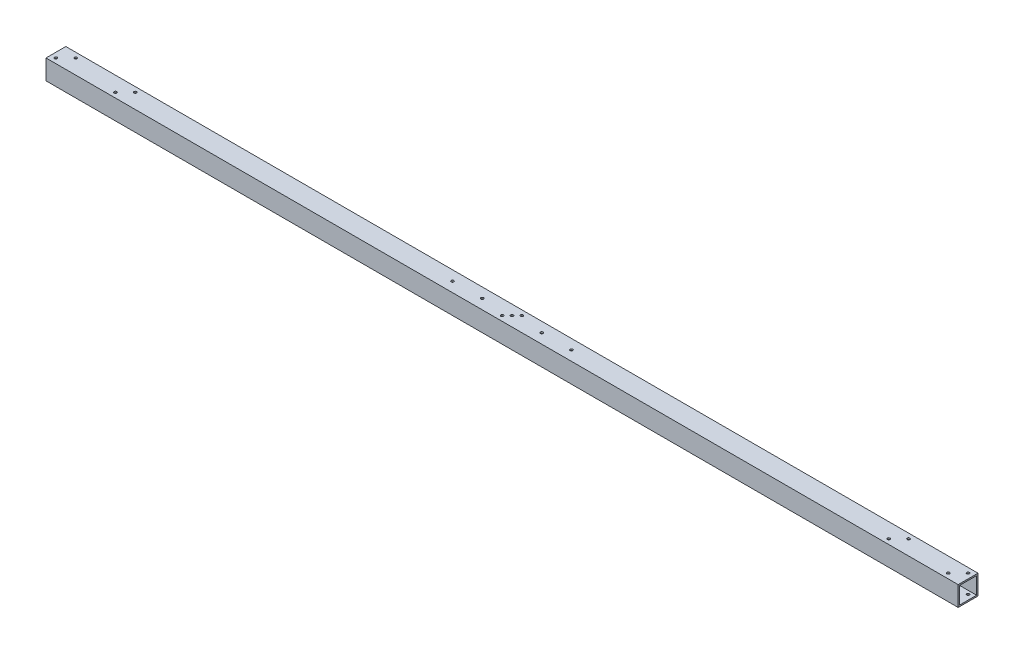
from build123d import *

# Parameters (mm, degrees)
SKETCH1_W          = 50.8
SKETCH1_H          = 50.8
SKETCH1_W_2        = 43.4848
SKETCH1_H_2        = 43.4848
EXTRUDE1_DEPTH     = 2336.8
SKETCH3_R          = 3.37312
CUT_EXTRUDE1_DEPTH = 2338.904086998
SKETCH4_R          = 3.37312
CUT_EXTRUDE2_DEPTH = 2338.904086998
SKETCH5_R          = 3.37312
CUT_EXTRUDE3_DEPTH = 2338.904086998


with BuildPart() as part:
    # Sketch1 → Extrude1 (new body)
    with BuildSketch(Plane(origin=(0, 0, 0), x_dir=(0, 0, -1), z_dir=(1, 0, 0))):
        with Locations((25.4, 25.4)):
            Rectangle(SKETCH1_W, SKETCH1_H)
        with Locations((25.4, 25.4)):
            Rectangle(SKETCH1_W_2, SKETCH1_H_2, mode=Mode.SUBTRACT)
    extrude(amount=EXTRUDE1_DEPTH)

    # Sketch3 → Cut-Extrude1 (cut, through all)
    with BuildSketch(Plane(origin=(0, 50.8, 0), x_dir=(1, 0, 0), z_dir=(0, 1, 0))):
        with Locations(Location((12.7, 12.7, 0), (0, 0, 270))):
            Circle(SKETCH3_R)
        with Locations(Location((38.1, 38.1, 0), (0, 0, 270))):
            Circle(SKETCH3_R)
        with Locations(Location((2324.1, 38.1, 0), (0, 0, 270))):
            Circle(SKETCH3_R)
        with Locations(Location((2298.7, 12.7, 0), (0, 0, 270))):
            Circle(SKETCH3_R)
        with Locations(Location((190.5, 38.1, 0), (0, 0, 270))):
            Circle(SKETCH3_R)
        with Locations(Location((165.1, 12.7, 0), (0, 0, 270))):
            Circle(SKETCH3_R)
    extrude(amount=-CUT_EXTRUDE1_DEPTH, mode=Mode.SUBTRACT)

    # Sketch4 → Cut-Extrude2 (cut, through all)
    with BuildSketch(Plane.XZ):
        with Locations(Location((1168.398924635, -25.4, 0), (0, 0, 270))):
            Circle(SKETCH4_R)
        with Locations(Location((1092.198924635, -25.4, 0), (0, 0, 270))):
            Circle(SKETCH4_R)
        with Locations(Location((1015.998924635, -25.4, 0), (0, 0, 270))):
            Circle(SKETCH4_R)
        with Locations(Location((1244.598924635, -25.4, 0), (0, 0, 270))):
            Circle(SKETCH4_R)
        with Locations(Location((1320.798924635, -25.4, 0), (0, 0, 270))):
            Circle(SKETCH4_R)
    extrude(amount=-CUT_EXTRUDE2_DEPTH, mode=Mode.SUBTRACT)

    # Sketch5 → Cut-Extrude3 (cut, through all)
    with BuildSketch(Plane(origin=(0, 50.8, 0), x_dir=(1, 0, 0), z_dir=(0, 1, 0))):
        with Locations(Location((2146.3, 12.7, 0), (0, 0, 270))):
            Circle(SKETCH5_R)
        with Locations(Location((2171.7, 38.1, 0), (0, 0, 270))):
            Circle(SKETCH5_R)
        with Locations(Location((1155.698924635, 12.7, 0), (0, 0, 270))):
            Circle(SKETCH5_R)
        with Locations(Location((1181.098924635, 38.1, 0), (0, 0, 270))):
            Circle(SKETCH5_R)
    extrude(amount=-CUT_EXTRUDE3_DEPTH, mode=Mode.SUBTRACT)


solid = part.part
